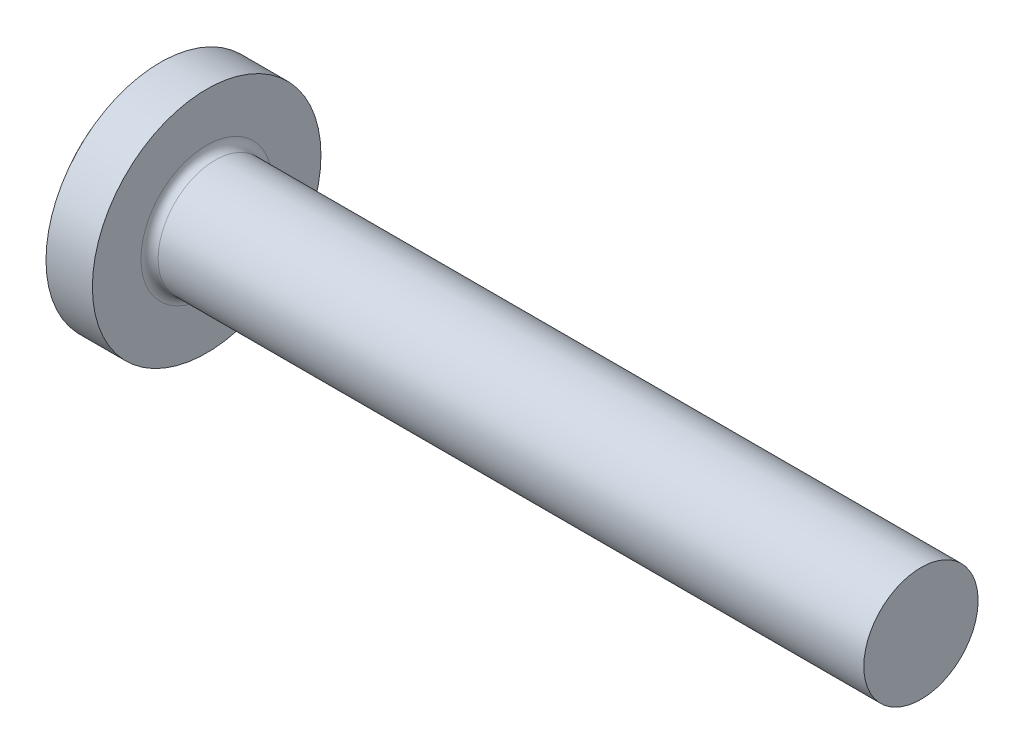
from build123d import *

# Parameters (mm, degrees)
FILLET1_R    = 0.6
RECPAT_COUNT = 2
RECPAT_ANGLE = 90


with BuildPart() as part:
    # BodySke → BaseBody (revolve)
    with BuildSketch(Plane.XY, mode=Mode.PRIVATE) as basebody_sk:
        with BuildLine():
            Line((6, 4), (6, 8))
            Line((6, 8), (2.753049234, 8))
            ThreePointArc((2.753049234, 8), (0.707515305, 4.230226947), (0, 0))
            Line((0, 0), (56, 0))
            Line((56, 0), (56, 4))
            Line((56, 4), (6, 4))
        make_face()
    revolve(basebody_sk.sketch.rotate(Axis((0, 0, 0), (1, 0, 0)), 90), axis=Axis((0, 0, 0), (1, 0, 0)))

    # Fillet1
    fillet1_edges = [part.edges().sort_by_distance(p)[0] for p in [
        (6, 0, -4),
    ]]
    fillet(fillet1_edges, radius=FILLET1_R)

    # RecSkeTop → Recess section 0
    with BuildSketch(Plane(origin=(0, 0, 0), x_dir=(0, 0, -1), z_dir=(1, 0, 0))):
        with BuildLine():
            Line((-0.968, 4.4), (0.968, 4.4))
            Line((0.968, 4.4), (0.968, -4.4))
            Line((0.968, -4.4), (-0.968, -4.4))
            Line((-0.968, -4.4), (-0.968, 4.4))
        make_face()
    # RecSkeBot → Recess section 1
    with BuildSketch(Plane(origin=(4.5, 0, 0), x_dir=(0, 0, -1), z_dir=(1, 0, 0))):
        with BuildLine():
            Line((-0.968, 2.156383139), (0.968, 2.156383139))
            Line((0.968, 2.156383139), (0.968, -2.156383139))
            Line((0.968, -2.156383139), (-0.968, -2.156383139))
            Line((-0.968, -2.156383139), (-0.968, 2.156383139))
        make_face()
    recess = loft(mode=Mode.SUBTRACT)

    # RecPat: Recess ×2 about axis
    recpat_axis = Axis((0, 0, 0), (1, 0, 0))
    for i in range(1, RECPAT_COUNT):
        add(recess.rotate(recpat_axis, i * RECPAT_ANGLE / (RECPAT_COUNT - 1)), mode=Mode.SUBTRACT)

    # RecCorSke → RecessCore (revolve, cut)
    with BuildSketch(Plane.XY, mode=Mode.PRIVATE) as recesscore_sk:
        Polygon((0, 0), (0, 2.1296), (4.5, 1.814929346), (5.089706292, 0), align=None)
    revolve(recesscore_sk.sketch.rotate(Axis((0, 0, 0), (1, 0, 0)), 346.581092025), axis=Axis((0, 0, 0), (1, 0, 0)), mode=Mode.SUBTRACT)


solid = part.part
